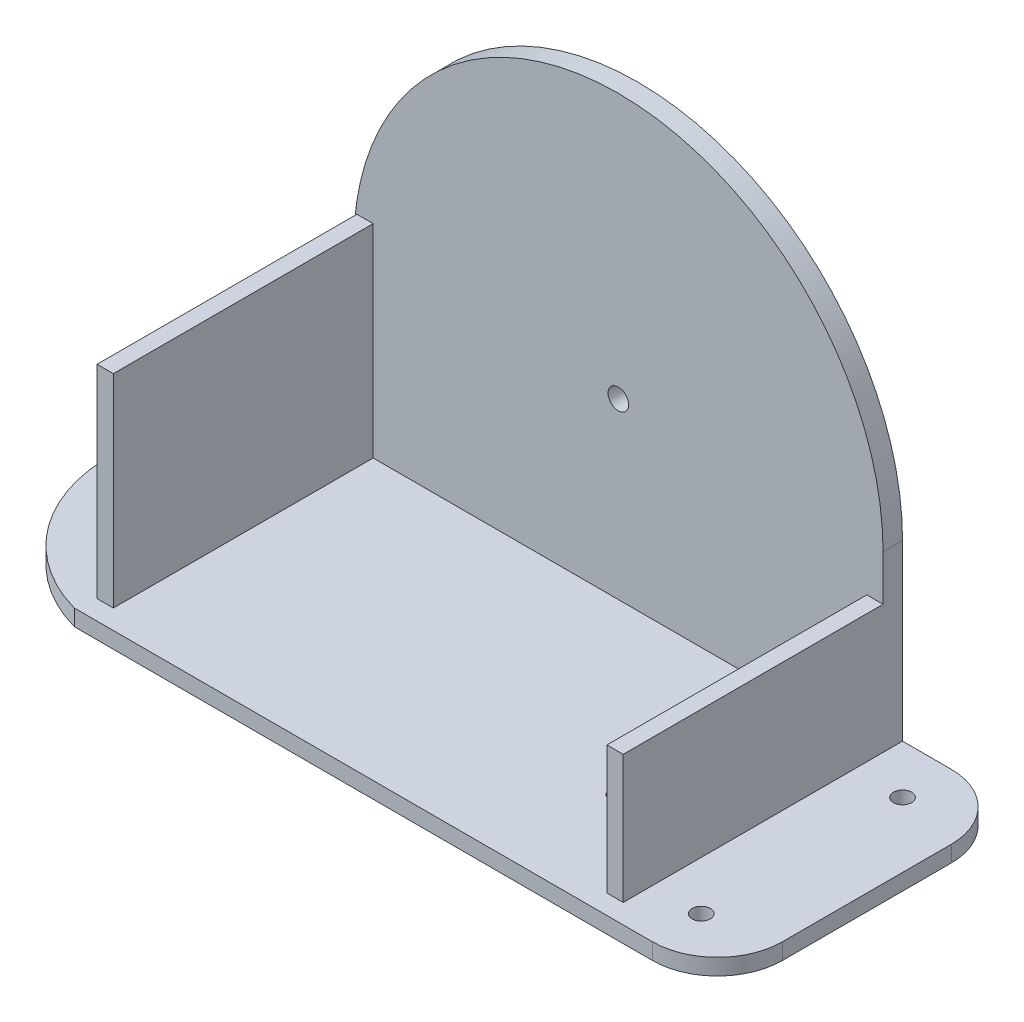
from build123d import *

# Parameters (mm, degrees)
PLATE_DEPTH        = 6
SKETCH2_W          = 5
SKETCH2_H          = 39.5
SKETCH2_H_2        = 62.5
SUPPORTWALLS_DEPTH = 80
SKETCH5_R          = 2.8
FLOOR_2_DEPTH      = 5
SKETCH2_4_R        = 3.175
CUT_EXTRUDE3_DEPTH = 167.16407554
SKETCH8_R          = 2
CUT_EXTRUDE4_DEPTH = 201.652062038
SKETCH9_R          = 3
CUT_EXTRUDE5_DEPTH = 3


with BuildPart() as part:
    # Sketch1 → Plate (new body)
    with BuildSketch(Plane.XY):
        with BuildLine():
            Line((-81.5, 0), (-81.5, -53.5))
            Line((-81.5, -53.5), (81.5, -53.5))
            Line((81.5, -53.5), (81.5, 0))
            ThreePointArc((81.5, 0), (0, 81.5), (-81.5, 0))
        make_face()
    extrude(amount=PLATE_DEPTH)

    # Sketch2 → SupportWalls (add)
    with BuildSketch(Plane.XY.offset(6)):
        with Locations((79, -33.75)):
            Rectangle(SKETCH2_W, SKETCH2_H)
        with Locations((-78, -22.25)):
            Rectangle(SKETCH2_W, SKETCH2_H_2)
    extrude(amount=SUPPORTWALLS_DEPTH)

    # Sketch2_4 → Cut-Extrude3 (cut, through all)
    with BuildSketch(Plane.XY.offset(6)):
        Circle(SKETCH2_4_R)
    extrude(amount=-CUT_EXTRUDE3_DEPTH, mode=Mode.SUBTRACT)


with BuildPart() as body_2:
    # Sketch5 → Floor 2 (new body)
    with BuildSketch(Plane.XZ.offset(53.5)):
        with BuildLine():
            Line((-81.5, 0), (96.5, 0))
            ThreePointArc((96.5, 0), (110.642135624, 5.857864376), (116.5, 20))
            Line((116.5, 20), (116.5, 72))
            ThreePointArc((116.5, 72), (110.642135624, 86.142135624), (96.5, 92))
            Line((96.5, 92), (-81.5, 92))
            ThreePointArc((-81.5, 92), (-116.5, 46), (-81.5, 0))
        make_face()
        with Locations(Location((96.5, 77, 0), (0, 0, 270))):
            Circle(SKETCH5_R, mode=Mode.SUBTRACT)
        with Locations(Location((96.5, 15, 0), (0, 0, 270))):
            Circle(SKETCH5_R, mode=Mode.SUBTRACT)
        with Locations(Location((-95.5, 46, 0), (0, 0, 270))):
            Circle(SKETCH5_R, mode=Mode.SUBTRACT)
    extrude(amount=FLOOR_2_DEPTH)

    # Sketch8 → Cut-Extrude4 (cut, through all)
    with BuildSketch(Plane(origin=(0, -53.5, 0), x_dir=(1, 0, 0), z_dir=(0, 1, 0))):
        with Locations(Location((51.5, -33.5, 0), (0, 0, 270))):
            Circle(SKETCH8_R)
        with Locations(Location((51.5, -58.5, 0), (0, 0, 270))):
            Circle(SKETCH8_R)
    extrude(amount=-CUT_EXTRUDE4_DEPTH, mode=Mode.SUBTRACT)

    # Sketch9 → Cut-Extrude5 (cut)
    with BuildSketch(Plane.XZ.offset(58.5)):
        with Locations(Location((51.5, 58.5, 0), (0, 0, 270))):
            Circle(SKETCH9_R)
        with Locations(Location((51.5, 33.5, 0), (0, 0, 270))):
            Circle(SKETCH9_R)
    extrude(amount=-CUT_EXTRUDE5_DEPTH, mode=Mode.SUBTRACT)


solid = Compound([part.part, body_2.part])
